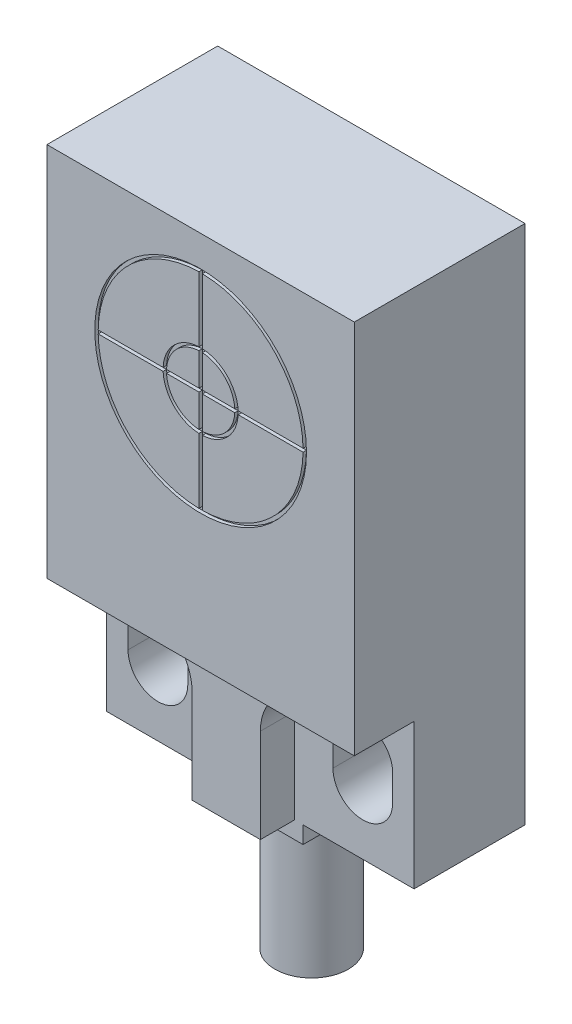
from build123d import *

# Parameters (mm, degrees)
SKETCH_1_W            = 18
SKETCH_1_H            = 30.5
EXTRUDE_2_DEPTH       = 10
CUT_EXTRUDE_1_DEPTH   = 3.5
CUT_EXTRUDE_2_DEPTH   = 1.5
CUT_EXTRUDE_3_DEPTH   = 6.5
CUT_EXTRUDE_4_DEPTH   = 6.5
EXTRUDE_3_DEPTH       = 1
SKETCH_10_R           = 2.15
EXTRUDE_5_DEPTH       = 8
SKETCH_11_R           = 6.2
SKETCH_11_R_2         = 6
CUT_EXTRUDE_5_DEPTH   = 0.2
SKETCH_12_R           = 2.2
SKETCH_12_R_2         = 2
CUT_EXTRUDE_6_DEPTH   = 0.2
SKETCH_13_W           = 12
SKETCH_13_H           = 0.2
SKETCH_13_W_2         = 0.2
SKETCH_13_H_2         = 12
CUT_EXTRUDE_1_2_DEPTH = 0.2
SKETCH_14_R           = 1.3
CUT_EXTRUDE_7_DEPTH   = 0.2


with BuildPart() as part:
    # Sketch 1 → Extrude 2 (new body)
    with BuildSketch(Plane.XY):
        with Locations((9, 15.25)):
            Rectangle(SKETCH_1_W, SKETCH_1_H)
    extrude(amount=EXTRUDE_2_DEPTH)

    # Sketch 3 → Cut-Extrude 1 (cut)
    with BuildSketch(Plane.XY.offset(10)):
        with BuildLine():
            Line((18, 0), (18, 8.5))
            Line((18, 8.5), (14, 8.5))
            ThreePointArc((14, 8.5), (11.878679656, 7.621320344), (11, 5.5))
            Line((11, 5.5), (11, 0))
            Line((11, 0), (18, 0))
        make_face()
        with BuildLine():
            Line((0, 8.5), (0, 0))
            Line((0, 0), (7, 0))
            Line((7, 0), (7, 5.5))
            ThreePointArc((7, 5.5), (6.121320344, 7.621320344), (4, 8.5))
            Line((4, 8.5), (0, 8.5))
        make_face()
    extrude(amount=-CUT_EXTRUDE_1_DEPTH, mode=Mode.SUBTRACT)

    # Sketch 4 → Cut-Extrude 2 (cut)
    with BuildSketch(Plane.XY.offset(10)):
        with BuildLine():
            Line((7, 0), (11, 0))
            Line((11, 0), (11, 5.5))
            ThreePointArc((11, 5.5), (11.878679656, 7.621320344), (14, 8.5))
            Line((14, 8.5), (4, 8.5))
            ThreePointArc((4, 8.5), (6.121320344, 7.621320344), (7, 5.5))
            Line((7, 5.5), (7, 0))
        make_face()
    extrude(amount=-CUT_EXTRUDE_2_DEPTH, mode=Mode.SUBTRACT)

    # Sketch 6 → Cut-Extrude 3 (cut)
    with BuildSketch(Plane.XY.offset(6.5)):
        with BuildLine():
            Line((16.75, 5.25), (16.75, 3.75))
            ThreePointArc((16.75, 3.75), (15, 2), (13.25, 3.75))
            Line((13.25, 3.75), (13.25, 5.25))
            ThreePointArc((13.25, 5.25), (15, 7), (16.75, 5.25))
        make_face()
    extrude(amount=-CUT_EXTRUDE_3_DEPTH, mode=Mode.SUBTRACT)

    # Sketch 7 → Cut-Extrude 4 (cut)
    with BuildSketch(Plane.XY.offset(6.5)):
        with BuildLine():
            Line((1.25, 5.25), (1.25, 3.75))
            ThreePointArc((1.25, 3.75), (3, 2), (4.75, 3.75))
            Line((4.75, 3.75), (4.75, 5.25))
            ThreePointArc((4.75, 5.25), (3, 7), (1.25, 5.25))
        make_face()
    extrude(amount=-CUT_EXTRUDE_4_DEPTH, mode=Mode.SUBTRACT)

    # Sketch 9 → Extrude 3 (add)
    with BuildSketch(Plane.XZ):
        Polygon((9, 6.5), (11.5, 6.5), (11.5, 0.5), (6.5, 0.5), (6.5, 6.5), align=None)
    extrude(amount=EXTRUDE_3_DEPTH)

    # Sketch 10 → Extrude 5 (add)
    with BuildSketch(Plane.XZ.offset(1)):
        with Locations(Location((9, 3.5, 0), (0, 0, 90))):
            Circle(SKETCH_10_R)
    extrude(amount=EXTRUDE_5_DEPTH)

    # Sketch 11 → Cut-Extrude 5 (cut)
    with BuildSketch(Plane.XY.offset(10)):
        with Locations((9, 22.5)):
            Circle(SKETCH_11_R)
        with Locations((9, 22.5)):
            Circle(SKETCH_11_R_2, mode=Mode.SUBTRACT)
    extrude(amount=-CUT_EXTRUDE_5_DEPTH, mode=Mode.SUBTRACT)

    # Sketch 12 → Cut-Extrude 6 (cut)
    with BuildSketch(Plane.XY.offset(10)):
        with Locations((9, 22.5)):
            Circle(SKETCH_12_R)
        with Locations((9, 22.5)):
            Circle(SKETCH_12_R_2, mode=Mode.SUBTRACT)
    extrude(amount=-CUT_EXTRUDE_6_DEPTH, mode=Mode.SUBTRACT)

    # Sketch 13 → Cut-Extrude 1 2 (cut)
    with BuildSketch(Plane.XY.offset(10)):
        with Locations((9, 22.5)):
            Rectangle(SKETCH_13_W, SKETCH_13_H)
        with Locations((9, 22.5)):
            Rectangle(SKETCH_13_W_2, SKETCH_13_H_2)
    extrude(amount=-CUT_EXTRUDE_1_2_DEPTH, mode=Mode.SUBTRACT)

    # Sketch 14 → Cut-Extrude 7 (cut)
    with BuildSketch(Plane.ZY):
        with Locations((7.5, 12.5)):
            Circle(SKETCH_14_R)
    extrude(amount=-CUT_EXTRUDE_7_DEPTH, mode=Mode.SUBTRACT)


solid = part.part
